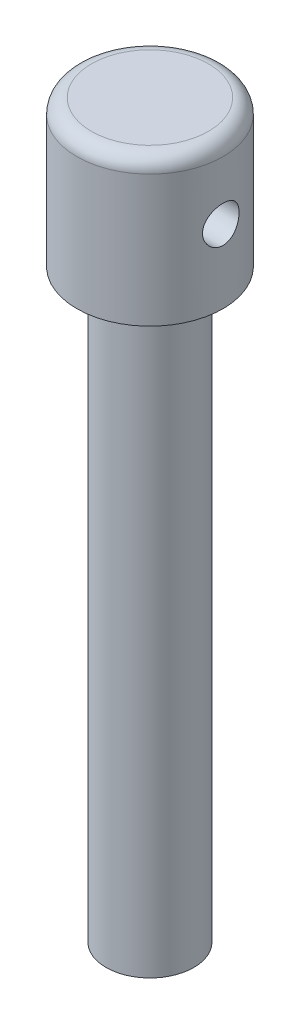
ISO-10303-21;
HEADER;
FILE_DESCRIPTION(('STEP AP214'),'2;1');
FILE_NAME('part.step','',(''),(''),'','','');
FILE_SCHEMA(('AUTOMOTIVE_DESIGN { 1 0 10303 214 1 1 1 1 }'));
ENDSEC;
DATA;
#1=APPLICATION_CONTEXT('core data for automotive mechanical design processes');
#2=APPLICATION_PROTOCOL_DEFINITION('international standard','automotive_design',2000,#1);
#3=PRODUCT_CONTEXT('',#1,'mechanical');
#4=PRODUCT('Part','Part','',(#3));
#5=PRODUCT_RELATED_PRODUCT_CATEGORY('part','',(#4));
#6=PRODUCT_DEFINITION_FORMATION('','',#4);
#7=PRODUCT_DEFINITION_CONTEXT('part definition',#1,'design');
#8=PRODUCT_DEFINITION('design','',#6,#7);
#9=PRODUCT_DEFINITION_SHAPE('','',#8);
#10=(LENGTH_UNIT() NAMED_UNIT(*) SI_UNIT(.MILLI.,.METRE.));
#11=(NAMED_UNIT(*) PLANE_ANGLE_UNIT() SI_UNIT($,.RADIAN.));
#12=(NAMED_UNIT(*) SI_UNIT($,.STERADIAN.) SOLID_ANGLE_UNIT());
#13=UNCERTAINTY_MEASURE_WITH_UNIT(LENGTH_MEASURE(1.E-05),#10,'distance_accuracy_value','');
#14=(GEOMETRIC_REPRESENTATION_CONTEXT(3) GLOBAL_UNCERTAINTY_ASSIGNED_CONTEXT((#13)) GLOBAL_UNIT_ASSIGNED_CONTEXT((#10,
#11,#12)) REPRESENTATION_CONTEXT('',''));
#15=CARTESIAN_POINT('',(0.,0.,0.));
#16=DIRECTION('',(0.,0.,1.));
#17=DIRECTION('',(1.,0.,0.));
#18=AXIS2_PLACEMENT_3D('',#15,#16,#17);
#19=CARTESIAN_POINT('',(0.,114.,0.));
#20=DIRECTION('',(0.,-1.,0.));
#21=DIRECTION('',(0.,0.,-1.));
#22=AXIS2_PLACEMENT_3D('',#19,#20,#21);
#23=CYLINDRICAL_SURFACE('',#22,6.);
#24=CARTESIAN_POINT('',(0.,114.,0.));
#25=DIRECTION('',(0.,1.,0.));
#26=DIRECTION('',(0.,0.,1.));
#27=AXIS2_PLACEMENT_3D('',#24,#25,#26);
#28=CIRCLE('',#27,6.);
#29=CARTESIAN_POINT('',(0.,114.,6.));
#30=VERTEX_POINT('',#29);
#31=EDGE_CURVE('E91',#30,#30,#28,.T.);
#32=ORIENTED_EDGE('',*,*,#31,.F.);
#33=EDGE_LOOP('',(#32));
#34=FACE_BOUND('',#33,.T.);
#35=CARTESIAN_POINT('',(0.,34.,0.));
#36=DIRECTION('',(0.,1.,0.));
#37=DIRECTION('',(0.,0.,1.));
#38=AXIS2_PLACEMENT_3D('',#35,#36,#37);
#39=CIRCLE('',#38,6.);
#40=CARTESIAN_POINT('',(0.,34.,6.));
#41=VERTEX_POINT('',#40);
#42=EDGE_CURVE('E94',#41,#41,#39,.T.);
#43=ORIENTED_EDGE('',*,*,#42,.T.);
#44=EDGE_LOOP('',(#43));
#45=FACE_BOUND('',#44,.T.);
#46=ADVANCED_FACE('F36',(#34,#45),#23,.T.);
#47=CARTESIAN_POINT('',(0.,34.,0.));
#48=DIRECTION('',(0.,1.,0.));
#49=DIRECTION('',(0.,0.,1.));
#50=AXIS2_PLACEMENT_3D('',#47,#48,#49);
#51=PLANE('',#50);
#52=ORIENTED_EDGE('',*,*,#42,.F.);
#53=EDGE_LOOP('',(#52));
#54=FACE_BOUND('',#53,.T.);
#55=ADVANCED_FACE('F83',(#54),#51,.F.);
#56=CARTESIAN_POINT('',(0.,134.,0.));
#57=DIRECTION('',(0.,-1.,0.));
#58=DIRECTION('',(0.,0.,-1.));
#59=AXIS2_PLACEMENT_3D('',#56,#57,#58);
#60=CYLINDRICAL_SURFACE('',#59,10.);
#61=CARTESIAN_POINT('',(0.,132.,0.));
#62=DIRECTION('',(0.,1.,0.));
#63=DIRECTION('',(0.,0.,1.));
#64=AXIS2_PLACEMENT_3D('',#61,#62,#63);
#65=CIRCLE('',#64,10.);
#66=CARTESIAN_POINT('',(0.,132.,10.));
#67=VERTEX_POINT('',#66);
#68=EDGE_CURVE('E10',#67,#67,#65,.F.);
#69=ORIENTED_EDGE('',*,*,#68,.T.);
#70=EDGE_LOOP('',(#69));
#71=FACE_BOUND('',#70,.T.);
#72=CARTESIAN_POINT('',(-10.,121.5,0.));
#73=CARTESIAN_POINT('',(-9.99999766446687,121.50000387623,-0.138126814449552));
#74=CARTESIAN_POINT('',(-9.99710963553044,121.511485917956,-0.276296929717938));
#75=CARTESIAN_POINT('',(-9.98586856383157,121.557041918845,-0.548677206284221));
#76=CARTESIAN_POINT('',(-9.97751242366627,121.591128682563,-0.682885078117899));
#77=CARTESIAN_POINT('',(-9.9562604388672,121.680732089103,-0.943368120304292));
#78=CARTESIAN_POINT('',(-9.94337004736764,121.736222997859,-1.06965260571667));
#79=CARTESIAN_POINT('',(-9.91442239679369,121.866968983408,-1.31112021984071));
#80=CARTESIAN_POINT('',(-9.89836503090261,121.942224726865,-1.4263029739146));
#81=CARTESIAN_POINT('',(-9.86445689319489,122.11200131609,-1.64466987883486));
#82=CARTESIAN_POINT('',(-9.84657845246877,122.206852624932,-1.74759281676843));
#83=CARTESIAN_POINT('',(-9.81122700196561,122.412420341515,-1.93624821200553));
#84=CARTESIAN_POINT('',(-9.79375403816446,122.523138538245,-2.02197872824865));
#85=CARTESIAN_POINT('',(-9.76091292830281,122.759325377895,-2.17504423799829));
#86=CARTESIAN_POINT('',(-9.74557990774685,122.884988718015,-2.2420870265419));
#87=CARTESIAN_POINT('',(-9.71915824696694,123.146247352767,-2.35399484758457));
#88=CARTESIAN_POINT('',(-9.70806892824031,123.281841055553,-2.39886342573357));
#89=CARTESIAN_POINT('',(-9.69167461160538,123.556239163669,-2.46425806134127));
#90=CARTESIAN_POINT('',(-9.68625818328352,123.69492482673,-2.48525378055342));
#91=CARTESIAN_POINT('',(-9.68148937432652,123.973947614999,-2.50376962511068));
#92=CARTESIAN_POINT('',(-9.68213600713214,124.11428446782,-2.50129356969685));
#93=CARTESIAN_POINT('',(-9.68932009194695,124.389026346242,-2.47331087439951));
#94=CARTESIAN_POINT('',(-9.69571438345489,124.523492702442,-2.44836390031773));
#95=CARTESIAN_POINT('',(-9.71344516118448,124.786268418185,-2.377040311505));
#96=CARTESIAN_POINT('',(-9.72478199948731,124.914577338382,-2.33066217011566));
#97=CARTESIAN_POINT('',(-9.75125189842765,125.162896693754,-2.21731579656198));
#98=CARTESIAN_POINT('',(-9.76642212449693,125.282810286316,-2.15014444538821));
#99=CARTESIAN_POINT('',(-9.79882851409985,125.509864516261,-1.99726046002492));
#100=CARTESIAN_POINT('',(-9.81606503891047,125.617002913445,-1.91154458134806));
#101=CARTESIAN_POINT('',(-9.85126467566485,125.818672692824,-1.72110570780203));
#102=CARTESIAN_POINT('',(-9.86923449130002,125.912757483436,-1.61591043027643));
#103=CARTESIAN_POINT('',(-9.90343275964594,126.082035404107,-1.39101986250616));
#104=CARTESIAN_POINT('',(-9.91966115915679,126.157227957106,-1.27132412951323));
#105=CARTESIAN_POINT('',(-9.94862886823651,126.286750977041,-1.02019314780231));
#106=CARTESIAN_POINT('',(-9.96135600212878,126.341008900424,-0.888718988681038));
#107=CARTESIAN_POINT('',(-9.98179861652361,126.426528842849,-0.618126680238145));
#108=CARTESIAN_POINT('',(-9.98951505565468,126.457795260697,-0.479009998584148));
#109=CARTESIAN_POINT('',(-9.99892498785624,126.495762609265,-0.200899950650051));
#110=CARTESIAN_POINT('',(-10.0007675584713,126.503071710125,-0.0619945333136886));
#111=CARTESIAN_POINT('',(-9.99864674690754,126.494584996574,0.215054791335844));
#112=CARTESIAN_POINT('',(-9.99468388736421,126.478791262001,0.353198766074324));
#113=CARTESIAN_POINT('',(-9.98149301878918,126.425048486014,0.622690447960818));
#114=CARTESIAN_POINT('',(-9.97234390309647,126.387431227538,0.754108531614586));
#115=CARTESIAN_POINT('',(-9.94981177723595,126.291488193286,1.00876215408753));
#116=CARTESIAN_POINT('',(-9.93642833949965,126.233160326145,1.13199686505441));
#117=CARTESIAN_POINT('',(-9.9065551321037,126.096273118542,1.36920522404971));
#118=CARTESIAN_POINT('',(-9.89001445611,126.017373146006,1.48297573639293));
#119=CARTESIAN_POINT('',(-9.85574181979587,125.842016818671,1.69587768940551));
#120=CARTESIAN_POINT('',(-9.83800965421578,125.745557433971,1.79500659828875));
#121=CARTESIAN_POINT('',(-9.80281594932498,125.534996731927,1.97831761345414));
#122=CARTESIAN_POINT('',(-9.78537173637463,125.420520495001,2.06207311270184));
#123=CARTESIAN_POINT('',(-9.75321463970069,125.178778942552,2.20918459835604));
#124=CARTESIAN_POINT('',(-9.73850163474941,125.051514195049,2.27254149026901));
#125=CARTESIAN_POINT('',(-9.71363491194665,124.788490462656,2.37658570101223));
#126=CARTESIAN_POINT('',(-9.70345425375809,124.652787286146,2.41740732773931));
#127=CARTESIAN_POINT('',(-9.68877906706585,124.376150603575,2.47557609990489));
#128=CARTESIAN_POINT('',(-9.68428329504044,124.235218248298,2.49292837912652));
#129=CARTESIAN_POINT('',(-9.68158168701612,123.956464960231,2.50339765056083));
#130=CARTESIAN_POINT('',(-9.68319887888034,123.818670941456,2.49719649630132));
#131=CARTESIAN_POINT('',(-9.69213181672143,123.546160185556,2.46229546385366));
#132=CARTESIAN_POINT('',(-9.69944744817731,123.411443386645,2.43359603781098));
#133=CARTESIAN_POINT('',(-9.71885434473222,123.149652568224,2.35488553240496));
#134=CARTESIAN_POINT('',(-9.73091692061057,123.022537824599,2.30500234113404));
#135=CARTESIAN_POINT('',(-9.7584625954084,122.778391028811,2.18544152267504));
#136=CARTESIAN_POINT('',(-9.77394616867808,122.661360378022,2.11576115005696));
#137=CARTESIAN_POINT('',(-9.80709390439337,122.437408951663,1.95644624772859));
#138=CARTESIAN_POINT('',(-9.82480441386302,122.330831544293,1.86633860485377));
#139=CARTESIAN_POINT('',(-9.86013378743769,122.134088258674,1.66964895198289));
#140=CARTESIAN_POINT('',(-9.87775262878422,122.043926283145,1.56306303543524));
#141=CARTESIAN_POINT('',(-9.9112942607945,121.880981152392,1.33411264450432));
#142=CARTESIAN_POINT('',(-9.92718055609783,121.808542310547,1.21149737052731));
#143=CARTESIAN_POINT('',(-9.95508208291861,121.685420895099,0.955443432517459));
#144=CARTESIAN_POINT('',(-9.96710008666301,121.634722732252,0.8220126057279));
#145=CARTESIAN_POINT('',(-9.98413432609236,121.564046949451,0.574017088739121));
#146=CARTESIAN_POINT('',(-9.99004308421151,121.540081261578,0.460633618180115));
#147=CARTESIAN_POINT('',(-9.9979767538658,121.50805676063,0.231510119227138));
#148=CARTESIAN_POINT('',(-10.0000019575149,121.499996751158,0.115770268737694));
#149=CARTESIAN_POINT('',(-10.,121.5,0.));
#150=B_SPLINE_CURVE_WITH_KNOTS('',3,(#72,#73,#74,#75,#76,#77,#78,#79,#80,#81,#82,#83,#84,#85,
#86,#87,#88,#89,#90,#91,#92,#93,#94,#95,#96,#97,#98,#99,#100,#101,#102,#103,#104,#105,#106,#107,
#108,#109,#110,#111,#112,#113,#114,#115,#116,#117,#118,#119,#120,#121,#122,#123,#124,#125,#126,
#127,#128,#129,#130,#131,#132,#133,#134,#135,#136,#137,#138,#139,#140,#141,#142,#143,#144,#145,
#146,#147,#148,#149),.UNSPECIFIED.,.T.,.F.,(4,2,2,2,2,2,2,2,2,2,2,2,2,2,2,2,2,2,2,2,2,2,2,2,2,2,
2,2,2,2,2,2,2,2,2,2,2,2,4),(0.,0.41395618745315,0.828147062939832,1.24184150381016,
1.65554990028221,2.07690725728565,2.4983121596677,2.92597745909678,3.3535743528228,
3.77260491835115,4.19156730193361,4.6003749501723,5.00921172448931,5.42217546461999,
5.8352115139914,6.26002501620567,6.68485149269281,7.11113715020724,7.53734122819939,
7.95263848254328,8.36789835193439,8.7770045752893,9.18615212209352,9.6025597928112,
10.0190393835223,10.4457418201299,10.8724253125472,11.2965375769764,11.7205570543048,
12.1323963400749,12.5442273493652,12.9536066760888,13.3630428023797,13.7831596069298,
14.2033761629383,14.6312030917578,15.0587227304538,15.4057040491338,15.752659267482),.UNSPECIFIED.);
#151=CARTESIAN_POINT('',(-10.,121.5,0.));
#152=VERTEX_POINT('',#151);
#153=EDGE_CURVE('E47',#152,#152,#150,.T.);
#154=ORIENTED_EDGE('',*,*,#153,.T.);
#155=EDGE_LOOP('',(#154));
#156=FACE_BOUND('',#155,.T.);
#157=CARTESIAN_POINT('',(9.68245836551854,124.,-2.5));
#158=CARTESIAN_POINT('',(9.6824610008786,123.861949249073,-2.49999607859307));
#159=CARTESIAN_POINT('',(9.68544306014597,123.723855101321,-2.48852624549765));
#160=CARTESIAN_POINT('',(9.69701861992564,123.451632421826,-2.44302312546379));
#161=CARTESIAN_POINT('',(9.7056153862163,123.317506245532,-2.40897670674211));
#162=CARTESIAN_POINT('',(9.7273872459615,123.057196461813,-2.31949119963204));
#163=CARTESIAN_POINT('',(9.74055642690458,122.931002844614,-2.26407972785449));
#164=CARTESIAN_POINT('',(9.76998192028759,122.68968914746,-2.13352114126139));
#165=CARTESIAN_POINT('',(9.78623836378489,122.57456953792,-2.05837318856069));
#166=CARTESIAN_POINT('',(9.82040716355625,122.356138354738,-1.88870842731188));
#167=CARTESIAN_POINT('',(9.83834597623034,122.25310639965,-1.79383688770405));
#168=CARTESIAN_POINT('',(9.87362875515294,122.06423860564,-1.58818206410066));
#169=CARTESIAN_POINT('',(9.89097266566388,121.978404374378,-1.47739729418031));
#170=CARTESIAN_POINT('',(9.92340415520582,121.825224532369,-1.24114520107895));
#171=CARTESIAN_POINT('',(9.93845687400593,121.758153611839,-1.11549457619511));
#172=CARTESIAN_POINT('',(9.96430811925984,121.646190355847,-0.854263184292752));
#173=CARTESIAN_POINT('',(9.97510727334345,121.601294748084,-0.718683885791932));
#174=CARTESIAN_POINT('',(9.9910475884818,121.535852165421,-0.444358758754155));
#175=CARTESIAN_POINT('',(9.99629893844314,121.514830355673,-0.30573271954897));
#176=CARTESIAN_POINT('',(10.000935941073,121.496241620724,-0.026828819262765));
#177=CARTESIAN_POINT('',(10.000322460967,121.49867122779,0.113448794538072));
#178=CARTESIAN_POINT('',(9.99338094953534,121.52657485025,0.38838061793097));
#179=CARTESIAN_POINT('',(9.98718002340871,121.551536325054,0.523090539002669));
#180=CARTESIAN_POINT('',(9.96990836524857,121.622971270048,0.786345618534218));
#181=CARTESIAN_POINT('',(9.95883737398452,121.669445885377,0.914890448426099));
#182=CARTESIAN_POINT('',(9.93287509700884,121.783002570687,1.16351675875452));
#183=CARTESIAN_POINT('',(9.91795019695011,121.850267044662,1.28351127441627));
#184=CARTESIAN_POINT('',(9.88589903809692,122.003355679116,1.51068905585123));
#185=CARTESIAN_POINT('',(9.8687723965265,122.089183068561,1.61787008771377));
#186=CARTESIAN_POINT('',(9.83363713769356,122.279708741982,1.81943508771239));
#187=CARTESIAN_POINT('',(9.81561719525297,122.384854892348,1.91339419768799));
#188=CARTESIAN_POINT('',(9.78115043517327,122.60959997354,2.08244093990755));
#189=CARTESIAN_POINT('',(9.76470369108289,122.729199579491,2.15752769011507));
#190=CARTESIAN_POINT('',(9.73520496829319,122.980290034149,2.28697032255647));
#191=CARTESIAN_POINT('',(9.72216983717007,123.111835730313,2.34122391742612));
#192=CARTESIAN_POINT('',(9.70118640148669,123.382585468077,2.42671405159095));
#193=CARTESIAN_POINT('',(9.69323700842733,123.521787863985,2.45795551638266));
#194=CARTESIAN_POINT('',(9.68355356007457,123.79995950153,2.49582963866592));
#195=CARTESIAN_POINT('',(9.68166088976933,123.938837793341,2.50309047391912));
#196=CARTESIAN_POINT('',(9.68387343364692,124.215821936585,2.49451699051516));
#197=CARTESIAN_POINT('',(9.687978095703,124.353927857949,2.4786847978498));
#198=CARTESIAN_POINT('',(9.70157081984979,124.623114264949,2.42492546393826));
#199=CARTESIAN_POINT('',(9.71096970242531,124.754272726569,2.38736406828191));
#200=CARTESIAN_POINT('',(9.73400718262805,125.008431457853,2.29161808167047));
#201=CARTESIAN_POINT('',(9.74764628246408,125.131430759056,2.23343104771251));
#202=CARTESIAN_POINT('',(9.77796137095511,125.368441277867,2.09677066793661));
#203=CARTESIAN_POINT('',(9.79469168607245,125.482228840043,2.01792175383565));
#204=CARTESIAN_POINT('',(9.82917083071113,125.695188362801,1.84265073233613));
#205=CARTESIAN_POINT('',(9.84691982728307,125.79435791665,1.7462257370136));
#206=CARTESIAN_POINT('',(9.88197403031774,125.977811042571,1.53565680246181));
#207=CARTESIAN_POINT('',(9.8992570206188,126.061660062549,1.42112988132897));
#208=CARTESIAN_POINT('',(9.9309721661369,126.208935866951,1.17925670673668));
#209=CARTESIAN_POINT('',(9.94540447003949,126.272363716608,1.05191112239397));
#210=CARTESIAN_POINT('',(9.96970115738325,126.376446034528,0.78889550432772));
#211=CARTESIAN_POINT('',(9.97959830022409,126.417264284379,0.653293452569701));
#212=CARTESIAN_POINT('',(9.99385293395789,126.475460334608,0.376874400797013));
#213=CARTESIAN_POINT('',(9.99821149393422,126.492842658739,0.236058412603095));
#214=CARTESIAN_POINT('',(10.0008542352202,126.503418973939,-0.0427088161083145));
#215=CARTESIAN_POINT('',(9.99929947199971,126.497254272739,-0.18063456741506));
#216=CARTESIAN_POINT('',(9.99064741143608,126.462380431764,-0.45341874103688));
#217=CARTESIAN_POINT('',(9.98355027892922,126.433671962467,-0.588277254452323));
#218=CARTESIAN_POINT('',(9.96463582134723,126.354869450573,-0.850427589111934));
#219=CARTESIAN_POINT('',(9.95284411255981,126.304891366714,-0.977756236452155));
#220=CARTESIAN_POINT('',(9.92578222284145,126.185073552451,-1.22229263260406));
#221=CARTESIAN_POINT('',(9.91051160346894,126.115231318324,-1.33949910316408));
#222=CARTESIAN_POINT('',(9.87768124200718,125.95571191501,-1.56350482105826));
#223=CARTESIAN_POINT('',(9.86007542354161,125.86559964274,-1.66998747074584));
#224=CARTESIAN_POINT('',(9.82476622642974,125.668942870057,-1.86653755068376));
#225=CARTESIAN_POINT('',(9.80706282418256,125.562394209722,-1.95660081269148));
#226=CARTESIAN_POINT('',(9.77318689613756,125.333496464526,-2.11940506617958));
#227=CARTESIAN_POINT('',(9.75704909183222,125.210889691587,-2.19179154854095));
#228=CARTESIAN_POINT('',(9.7285988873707,124.954861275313,-2.31481724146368));
#229=CARTESIAN_POINT('',(9.71628370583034,124.821447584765,-2.36547227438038));
#230=CARTESIAN_POINT('',(9.69879771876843,124.573557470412,-2.43605632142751));
#231=CARTESIAN_POINT('',(9.69271657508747,124.460267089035,-2.4599829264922));
#232=CARTESIAN_POINT('',(9.6845459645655,124.231327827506,-2.49195573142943));
#233=CARTESIAN_POINT('',(9.68245615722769,124.115679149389,-2.50000328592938));
#234=CARTESIAN_POINT('',(9.68245836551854,124.,-2.5));
#235=B_SPLINE_CURVE_WITH_KNOTS('',3,(#157,#158,#159,#160,#161,#162,#163,#164,#165,#166,#167,
#168,#169,#170,#171,#172,#173,#174,#175,#176,#177,#178,#179,#180,#181,#182,#183,#184,#185,#186,
#187,#188,#189,#190,#191,#192,#193,#194,#195,#196,#197,#198,#199,#200,#201,#202,#203,#204,#205,
#206,#207,#208,#209,#210,#211,#212,#213,#214,#215,#216,#217,#218,#219,#220,#221,#222,#223,#224,
#225,#226,#227,#228,#229,#230,#231,#232,#233,#234),.UNSPECIFIED.,.T.,.F.,(4,2,2,2,2,2,2,2,2,2,2,
2,2,2,2,2,2,2,2,2,2,2,2,2,2,2,2,2,2,2,2,2,2,2,2,2,2,2,4),(0.,0.413727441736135,0.82769574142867,
1.24113072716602,1.65458326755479,2.07623954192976,2.49793521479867,2.92551496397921,
3.35303159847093,3.77188750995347,4.19068148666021,4.60018262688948,5.00970556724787,
5.42292874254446,5.83622385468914,6.26070466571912,6.68520531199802,7.11176432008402,
7.53823200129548,7.95343574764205,8.36860127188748,8.7769740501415,9.18539521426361,
9.60182845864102,10.0183301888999,10.4452533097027,10.872154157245,11.2959207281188,
11.7196054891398,12.131834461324,12.5440511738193,12.9540487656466,13.3640980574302,
13.7839709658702,14.2039503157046,14.6317647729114,15.0592672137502,15.4059782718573,
15.7526597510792),.UNSPECIFIED.);
#236=CARTESIAN_POINT('',(9.68245836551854,124.,-2.5));
#237=VERTEX_POINT('',#236);
#238=EDGE_CURVE('E51',#237,#237,#235,.T.);
#239=ORIENTED_EDGE('',*,*,#238,.T.);
#240=EDGE_LOOP('',(#239));
#241=FACE_BOUND('',#240,.T.);
#242=CARTESIAN_POINT('',(0.,114.,0.));
#243=DIRECTION('',(0.,1.,0.));
#244=DIRECTION('',(0.,0.,1.));
#245=AXIS2_PLACEMENT_3D('',#242,#243,#244);
#246=CIRCLE('',#245,10.);
#247=CARTESIAN_POINT('',(0.,114.,10.));
#248=VERTEX_POINT('',#247);
#249=EDGE_CURVE('E95',#248,#248,#246,.T.);
#250=ORIENTED_EDGE('',*,*,#249,.T.);
#251=EDGE_LOOP('',(#250));
#252=FACE_BOUND('',#251,.T.);
#253=ADVANCED_FACE('F63',(#71,#156,#241,#252),#60,.T.);
#254=CARTESIAN_POINT('',(0.,134.,0.));
#255=DIRECTION('',(0.,1.,0.));
#256=DIRECTION('',(0.,0.,1.));
#257=AXIS2_PLACEMENT_3D('',#254,#255,#256);
#258=PLANE('',#257);
#259=CARTESIAN_POINT('',(0.,134.,0.));
#260=DIRECTION('',(0.,1.,0.));
#261=DIRECTION('',(0.,0.,1.));
#262=AXIS2_PLACEMENT_3D('',#259,#260,#261);
#263=CIRCLE('',#262,8.);
#264=CARTESIAN_POINT('',(0.,134.,8.));
#265=VERTEX_POINT('',#264);
#266=EDGE_CURVE('E43',#265,#265,#263,.T.);
#267=ORIENTED_EDGE('',*,*,#266,.T.);
#268=EDGE_LOOP('',(#267));
#269=FACE_BOUND('',#268,.T.);
#270=ADVANCED_FACE('F73',(#269),#258,.T.);
#271=CARTESIAN_POINT('',(0.,114.,0.));
#272=DIRECTION('',(0.,1.,0.));
#273=DIRECTION('',(0.,0.,1.));
#274=AXIS2_PLACEMENT_3D('',#271,#272,#273);
#275=PLANE('',#274);
#276=ORIENTED_EDGE('',*,*,#31,.T.);
#277=EDGE_LOOP('',(#276));
#278=FACE_BOUND('',#277,.T.);
#279=ORIENTED_EDGE('',*,*,#249,.F.);
#280=EDGE_LOOP('',(#279));
#281=FACE_BOUND('',#280,.T.);
#282=ADVANCED_FACE('F71',(#278,#281),#275,.F.);
#283=CARTESIAN_POINT('',(-10.,124.,0.));
#284=DIRECTION('',(1.,0.,0.));
#285=DIRECTION('',(0.,0.,-1.));
#286=AXIS2_PLACEMENT_3D('',#283,#284,#285);
#287=CYLINDRICAL_SURFACE('',#286,2.5);
#288=ORIENTED_EDGE('',*,*,#238,.F.);
#289=EDGE_LOOP('',(#288));
#290=FACE_BOUND('',#289,.T.);
#291=ORIENTED_EDGE('',*,*,#153,.F.);
#292=EDGE_LOOP('',(#291));
#293=FACE_BOUND('',#292,.T.);
#294=ADVANCED_FACE('F67',(#290,#293),#287,.F.);
#295=CARTESIAN_POINT('',(0.,132.,0.));
#296=DIRECTION('',(0.,1.,0.));
#297=DIRECTION('',(0.,0.,1.));
#298=AXIS2_PLACEMENT_3D('',#295,#296,#297);
#299=TOROIDAL_SURFACE('',#298,8.,2.);
#300=ORIENTED_EDGE('',*,*,#68,.F.);
#301=EDGE_LOOP('',(#300));
#302=FACE_BOUND('',#301,.T.);
#303=ORIENTED_EDGE('',*,*,#266,.F.);
#304=EDGE_LOOP('',(#303));
#305=FACE_BOUND('',#304,.T.);
#306=ADVANCED_FACE('F38',(#302,#305),#299,.T.);
#307=CLOSED_SHELL('',(#46,#55,#253,#270,#282,#294,#306));
#308=MANIFOLD_SOLID_BREP('B2',#307);
#309=ADVANCED_BREP_SHAPE_REPRESENTATION('',(#18,#308),#14);
#310=SHAPE_DEFINITION_REPRESENTATION(#9,#309);
ENDSEC;
END-ISO-10303-21;
